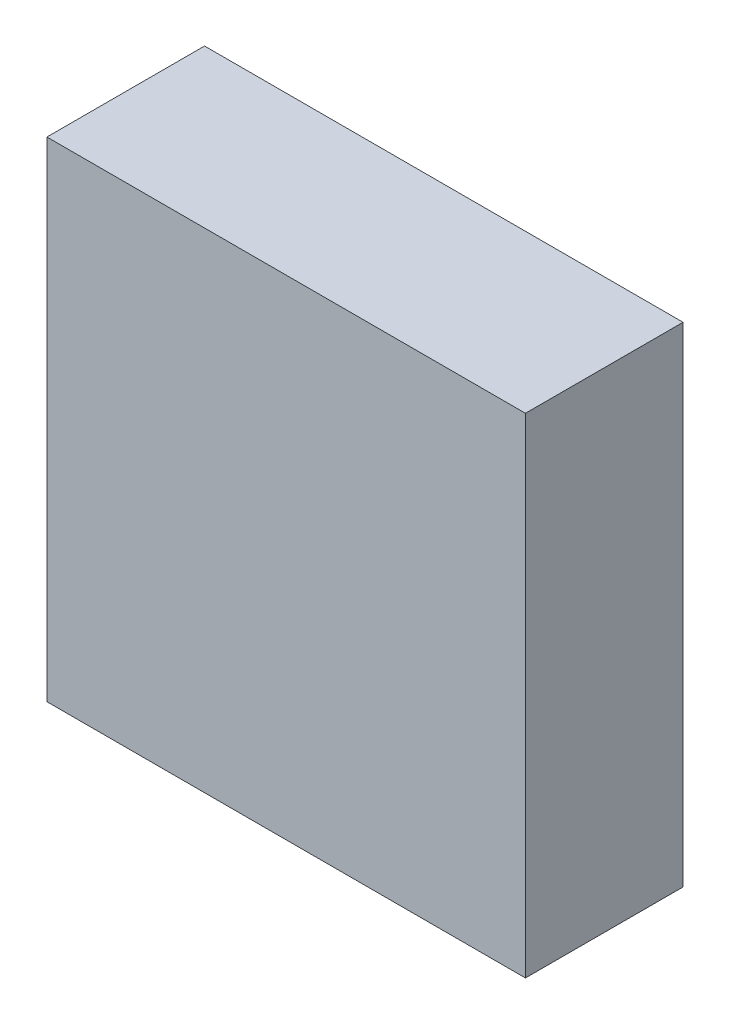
ISO-10303-21;
HEADER;
FILE_DESCRIPTION(('STEP AP214'),'2;1');
FILE_NAME('part.step','',(''),(''),'','','');
FILE_SCHEMA(('AUTOMOTIVE_DESIGN { 1 0 10303 214 1 1 1 1 }'));
ENDSEC;
DATA;
#1=APPLICATION_CONTEXT('core data for automotive mechanical design processes');
#2=APPLICATION_PROTOCOL_DEFINITION('international standard','automotive_design',2000,#1);
#3=PRODUCT_CONTEXT('',#1,'mechanical');
#4=PRODUCT('Part','Part','',(#3));
#5=PRODUCT_RELATED_PRODUCT_CATEGORY('part','',(#4));
#6=PRODUCT_DEFINITION_FORMATION('','',#4);
#7=PRODUCT_DEFINITION_CONTEXT('part definition',#1,'design');
#8=PRODUCT_DEFINITION('design','',#6,#7);
#9=PRODUCT_DEFINITION_SHAPE('','',#8);
#10=(LENGTH_UNIT() NAMED_UNIT(*) SI_UNIT(.MILLI.,.METRE.));
#11=(NAMED_UNIT(*) PLANE_ANGLE_UNIT() SI_UNIT($,.RADIAN.));
#12=(NAMED_UNIT(*) SI_UNIT($,.STERADIAN.) SOLID_ANGLE_UNIT());
#13=UNCERTAINTY_MEASURE_WITH_UNIT(LENGTH_MEASURE(1.E-05),#10,'distance_accuracy_value','');
#14=(GEOMETRIC_REPRESENTATION_CONTEXT(3) GLOBAL_UNCERTAINTY_ASSIGNED_CONTEXT((#13)) GLOBAL_UNIT_ASSIGNED_CONTEXT((#10,
#11,#12)) REPRESENTATION_CONTEXT('',''));
#15=CARTESIAN_POINT('',(0.,0.,0.));
#16=DIRECTION('',(0.,0.,1.));
#17=DIRECTION('',(1.,0.,0.));
#18=AXIS2_PLACEMENT_3D('',#15,#16,#17);
#19=CARTESIAN_POINT('',(-0.249999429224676,-2.74999964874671,0.));
#20=DIRECTION('',(-1.,-1.19248806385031E-08,0.));
#21=DIRECTION('',(-1.19248806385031E-08,1.,0.));
#22=AXIS2_PLACEMENT_3D('',#19,#20,#21);
#23=PLANE('',#22);
#24=DIRECTION('',(0.,0.,1.));
#25=VECTOR('',#24,1.);
#26=CARTESIAN_POINT('',(-0.249999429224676,-2.74999964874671,0.));
#27=LINE('',#26,#25);
#28=CARTESIAN_POINT('',(-0.249999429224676,-2.74999964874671,0.));
#29=VERTEX_POINT('',#28);
#30=CARTESIAN_POINT('',(-0.249999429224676,-2.74999964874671,1.1200003));
#31=VERTEX_POINT('',#30);
#32=EDGE_CURVE('E11',#29,#31,#27,.T.);
#33=ORIENTED_EDGE('',*,*,#32,.T.);
#34=DIRECTION('',(-1.19248806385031E-08,1.,0.));
#35=VECTOR('',#34,1.);
#36=CARTESIAN_POINT('',(-0.249999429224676,-2.74999964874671,1.1200003));
#37=LINE('',#36,#35);
#38=CARTESIAN_POINT('',(-0.24999947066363,0.724999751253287,1.1200003));
#39=VERTEX_POINT('',#38);
#40=EDGE_CURVE('E24',#31,#39,#37,.T.);
#41=ORIENTED_EDGE('',*,*,#40,.T.);
#42=DIRECTION('',(0.,0.,1.));
#43=VECTOR('',#42,1.);
#44=CARTESIAN_POINT('',(-0.24999947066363,0.724999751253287,0.));
#45=LINE('',#44,#43);
#46=CARTESIAN_POINT('',(-0.24999947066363,0.724999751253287,0.));
#47=VERTEX_POINT('',#46);
#48=EDGE_CURVE('E85',#47,#39,#45,.T.);
#49=ORIENTED_EDGE('',*,*,#48,.F.);
#50=DIRECTION('',(-1.19248806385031E-08,1.,0.));
#51=VECTOR('',#50,1.);
#52=CARTESIAN_POINT('',(-0.249999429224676,-2.74999964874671,0.));
#53=LINE('',#52,#51);
#54=EDGE_CURVE('E83',#29,#47,#53,.T.);
#55=ORIENTED_EDGE('',*,*,#54,.F.);
#56=EDGE_LOOP('',(#33,#41,#49,#55));
#57=FACE_BOUND('',#56,.T.);
#58=ADVANCED_FACE('F17',(#57),#23,.T.);
#59=CARTESIAN_POINT('',(-0.24999947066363,0.724999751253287,0.));
#60=DIRECTION('',(-1.19248806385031E-08,1.,0.));
#61=DIRECTION('',(1.,1.19248806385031E-08,0.));
#62=AXIS2_PLACEMENT_3D('',#59,#60,#61);
#63=PLANE('',#62);
#64=ORIENTED_EDGE('',*,*,#48,.T.);
#65=DIRECTION('',(1.,1.19248806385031E-08,0.));
#66=VECTOR('',#65,1.);
#67=CARTESIAN_POINT('',(-0.24999947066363,0.724999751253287,1.1200003));
#68=LINE('',#67,#66);
#69=CARTESIAN_POINT('',(3.14999880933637,0.724999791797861,1.1200003));
#70=VERTEX_POINT('',#69);
#71=EDGE_CURVE('E81',#39,#70,#68,.T.);
#72=ORIENTED_EDGE('',*,*,#71,.T.);
#73=DIRECTION('',(0.,0.,1.));
#74=VECTOR('',#73,1.);
#75=CARTESIAN_POINT('',(3.14999880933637,0.724999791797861,0.));
#76=LINE('',#75,#74);
#77=CARTESIAN_POINT('',(3.14999880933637,0.724999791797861,0.));
#78=VERTEX_POINT('',#77);
#79=EDGE_CURVE('E79',#78,#70,#76,.T.);
#80=ORIENTED_EDGE('',*,*,#79,.F.);
#81=DIRECTION('',(1.,1.19248806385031E-08,0.));
#82=VECTOR('',#81,1.);
#83=CARTESIAN_POINT('',(-0.24999947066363,0.724999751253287,0.));
#84=LINE('',#83,#82);
#85=EDGE_CURVE('E61',#47,#78,#84,.T.);
#86=ORIENTED_EDGE('',*,*,#85,.F.);
#87=EDGE_LOOP('',(#64,#72,#80,#86));
#88=FACE_BOUND('',#87,.T.);
#89=ADVANCED_FACE('F90',(#88),#63,.T.);
#90=CARTESIAN_POINT('',(3.14999880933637,0.724999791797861,0.));
#91=DIRECTION('',(1.,1.19248806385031E-08,0.));
#92=DIRECTION('',(1.19248806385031E-08,-1.,0.));
#93=AXIS2_PLACEMENT_3D('',#90,#91,#92);
#94=PLANE('',#93);
#95=ORIENTED_EDGE('',*,*,#79,.T.);
#96=DIRECTION('',(1.19248806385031E-08,-1.,0.));
#97=VECTOR('',#96,1.);
#98=CARTESIAN_POINT('',(3.14999880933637,0.724999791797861,1.1200003));
#99=LINE('',#98,#97);
#100=CARTESIAN_POINT('',(3.14999885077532,-2.74999960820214,1.1200003));
#101=VERTEX_POINT('',#100);
#102=EDGE_CURVE('E70',#70,#101,#99,.T.);
#103=ORIENTED_EDGE('',*,*,#102,.T.);
#104=DIRECTION('',(0.,0.,1.));
#105=VECTOR('',#104,1.);
#106=CARTESIAN_POINT('',(3.14999885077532,-2.74999960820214,0.));
#107=LINE('',#106,#105);
#108=CARTESIAN_POINT('',(3.14999885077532,-2.74999960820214,0.));
#109=VERTEX_POINT('',#108);
#110=EDGE_CURVE('E64',#109,#101,#107,.T.);
#111=ORIENTED_EDGE('',*,*,#110,.F.);
#112=DIRECTION('',(1.19248806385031E-08,-1.,0.));
#113=VECTOR('',#112,1.);
#114=CARTESIAN_POINT('',(3.14999880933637,0.724999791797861,0.));
#115=LINE('',#114,#113);
#116=EDGE_CURVE('E55',#78,#109,#115,.T.);
#117=ORIENTED_EDGE('',*,*,#116,.F.);
#118=EDGE_LOOP('',(#95,#103,#111,#117));
#119=FACE_BOUND('',#118,.T.);
#120=ADVANCED_FACE('F68',(#119),#94,.T.);
#121=CARTESIAN_POINT('',(3.14999885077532,-2.74999960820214,0.));
#122=DIRECTION('',(1.19248806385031E-08,-1.,0.));
#123=DIRECTION('',(-1.,-1.19248806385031E-08,0.));
#124=AXIS2_PLACEMENT_3D('',#121,#122,#123);
#125=PLANE('',#124);
#126=ORIENTED_EDGE('',*,*,#110,.T.);
#127=DIRECTION('',(-1.,-1.19248806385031E-08,0.));
#128=VECTOR('',#127,1.);
#129=CARTESIAN_POINT('',(3.14999885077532,-2.74999960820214,1.1200003));
#130=LINE('',#129,#128);
#131=EDGE_CURVE('E65',#101,#31,#130,.T.);
#132=ORIENTED_EDGE('',*,*,#131,.T.);
#133=ORIENTED_EDGE('',*,*,#32,.F.);
#134=DIRECTION('',(-1.,-1.19248806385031E-08,0.));
#135=VECTOR('',#134,1.);
#136=CARTESIAN_POINT('',(3.14999885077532,-2.74999960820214,0.));
#137=LINE('',#136,#135);
#138=EDGE_CURVE('E59',#109,#29,#137,.T.);
#139=ORIENTED_EDGE('',*,*,#138,.F.);
#140=EDGE_LOOP('',(#126,#132,#133,#139));
#141=FACE_BOUND('',#140,.T.);
#142=ADVANCED_FACE('F73',(#141),#125,.T.);
#143=CARTESIAN_POINT('',(-0.249999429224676,-2.74999964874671,0.));
#144=DIRECTION('',(0.,0.,1.));
#145=DIRECTION('',(1.19248806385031E-08,-1.,0.));
#146=AXIS2_PLACEMENT_3D('',#143,#144,#145);
#147=PLANE('',#146);
#148=ORIENTED_EDGE('',*,*,#54,.T.);
#149=ORIENTED_EDGE('',*,*,#85,.T.);
#150=ORIENTED_EDGE('',*,*,#116,.T.);
#151=ORIENTED_EDGE('',*,*,#138,.T.);
#152=EDGE_LOOP('',(#148,#149,#150,#151));
#153=FACE_BOUND('',#152,.T.);
#154=ADVANCED_FACE('F58',(#153),#147,.F.);
#155=CARTESIAN_POINT('',(-0.249999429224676,-2.74999964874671,1.1200003));
#156=DIRECTION('',(0.,0.,1.));
#157=DIRECTION('',(1.19248806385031E-08,-1.,0.));
#158=AXIS2_PLACEMENT_3D('',#155,#156,#157);
#159=PLANE('',#158);
#160=ORIENTED_EDGE('',*,*,#131,.F.);
#161=ORIENTED_EDGE('',*,*,#102,.F.);
#162=ORIENTED_EDGE('',*,*,#71,.F.);
#163=ORIENTED_EDGE('',*,*,#40,.F.);
#164=EDGE_LOOP('',(#160,#161,#162,#163));
#165=FACE_BOUND('',#164,.T.);
#166=ADVANCED_FACE('F91',(#165),#159,.T.);
#167=CLOSED_SHELL('',(#58,#89,#120,#142,#154,#166));
#168=MANIFOLD_SOLID_BREP('B1',#167);
#169=ADVANCED_BREP_SHAPE_REPRESENTATION('',(#18,#168),#14);
#170=SHAPE_DEFINITION_REPRESENTATION(#9,#169);
ENDSEC;
END-ISO-10303-21;
